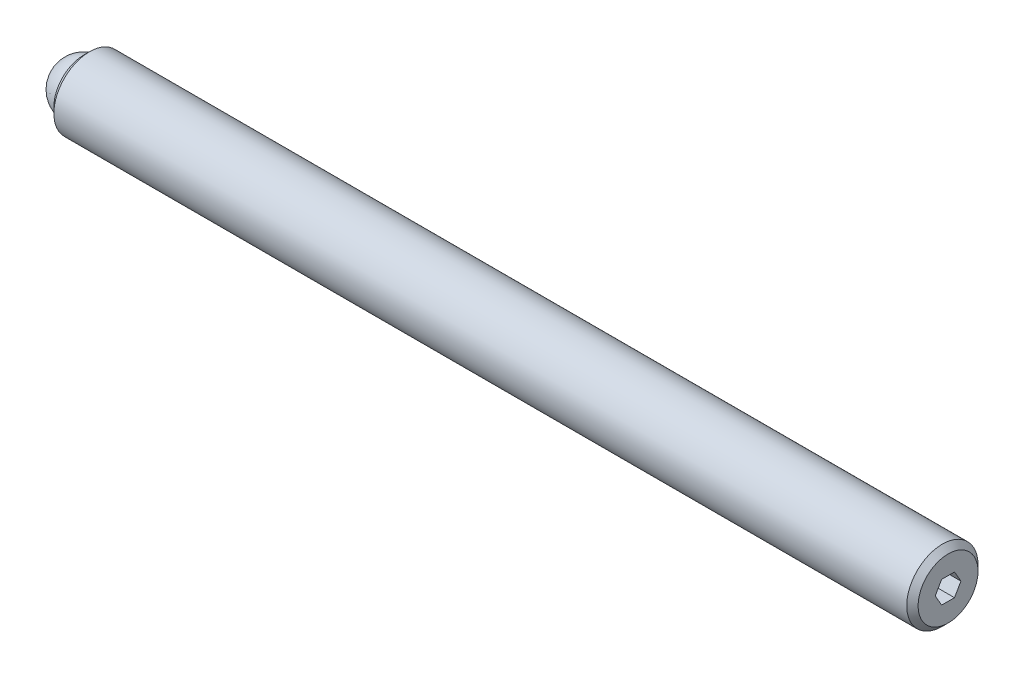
from build123d import *

# Parameters (mm, degrees)
SKETCH2_R           = 3.175
BOSS_EXTRUDE1_DEPTH = 76.99375
CHAMFER1_SIZE       = 0.508
CHAMFER2_SIZE       = 0.508
CUT_EXTRUDE2_DEPTH  = 2.286
SKETCH3_R           = 2.38125
CUT_EXTRUDE3_DEPTH  = 1.984375


with BuildPart() as part:
    # Sketch2 → Boss-Extrude1 (new body)
    with BuildSketch(Plane(origin=(0, 0, 0), x_dir=(0, 0, -1), z_dir=(1, 0, 0))):
        Circle(SKETCH2_R)
    extrude(amount=BOSS_EXTRUDE1_DEPTH)

    # Chamfer1
    chamfer1_edges = [part.edges().sort_by_distance(p)[0] for p in [
        (0, 0, 3.175),
    ]]
    chamfer(chamfer1_edges, length=CHAMFER1_SIZE)

    # Chamfer2
    chamfer2_edges = [part.edges().sort_by_distance(p)[0] for p in [
        (76.99375, 0, 3.175),
    ]]
    chamfer(chamfer2_edges, length=CHAMFER2_SIZE)

    # Sketch4 → Cut-Extrude2 (cut)
    with BuildSketch(Plane(origin=(76.99375, 0, 0), x_dir=(0, 0, -1), z_dir=(1, 0, 0))):
        Polygon((1.14567944, 0), (0.57283972, 0.9921875), (-0.57283972, 0.9921875), (-1.14567944, 0), (-0.57283972, -0.9921875), (0.57283972, -0.9921875), align=None)
    extrude(amount=-CUT_EXTRUDE2_DEPTH, mode=Mode.SUBTRACT)

    # Sketch3 → Cut-Extrude3 (cut)
    with BuildSketch(Plane.ZY):
        Circle(SKETCH3_R)
    extrude(amount=-CUT_EXTRUDE3_DEPTH, mode=Mode.SUBTRACT)


with BuildPart() as body_2:
    # Sketch5 → Revolve1 (revolve)
    with BuildSketch(Plane.ZY):
        with BuildLine():
            Line((0, 0), (0, -2.38125))
            ThreePointArc((0, -2.38125), (-2.38125, 0), (0, 2.38125))
            Line((0, 2.38125), (0, 0))
        make_face()
    revolve(axis=Axis((0, 0, 0), (0, 1, 0)))


solid = Compound([part.part, body_2.part])
